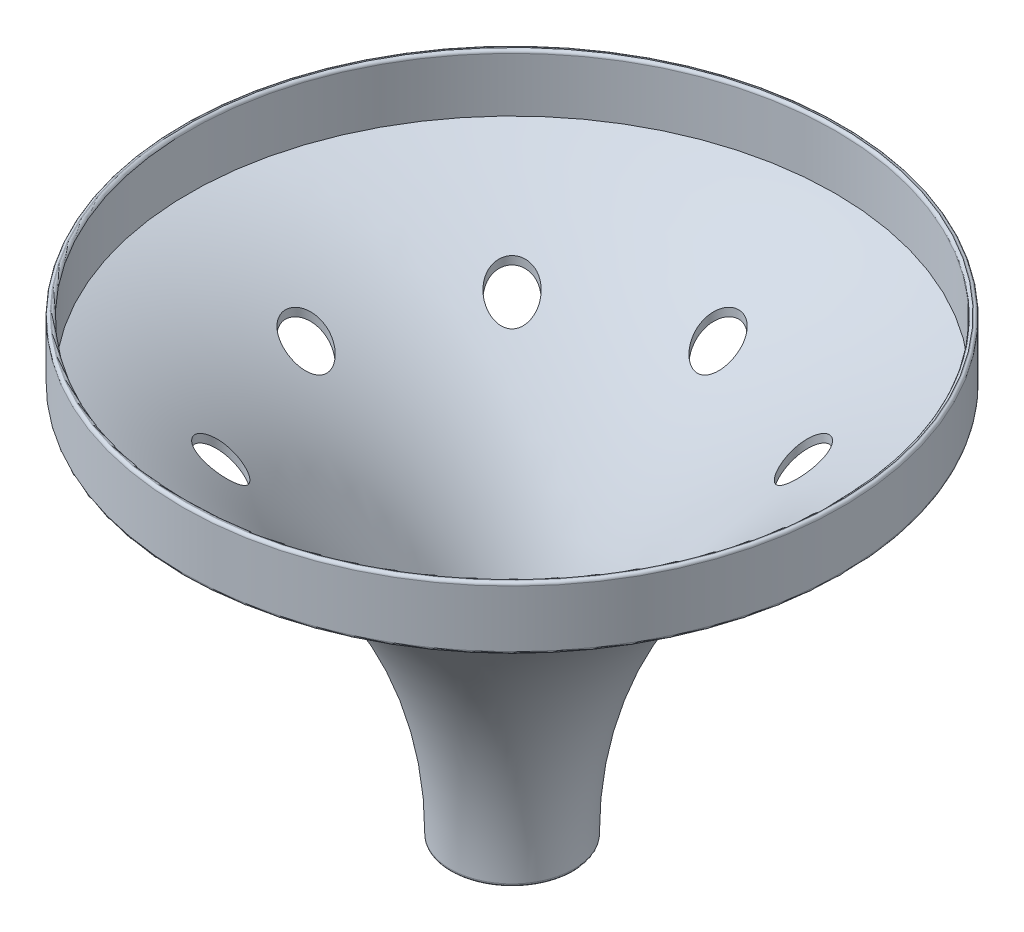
from build123d import *

# Parameters (mm, degrees)
SHELL1_T           = -1.016
SKETCH2_R          = 3.175
CUT_EXTRUDE1_DEPTH = 101.201309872
CIRPATTERN1_COUNT  = 8
FILLET1_R          = 0.4572


with BuildPart() as part:
    # Sketch1 → Revolve1 (revolve)
    with BuildSketch(Plane.XY, mode=Mode.PRIVATE) as revolve1_sk:
        with BuildLine():
            Line((0, 69.85), (50.8, 69.85))
            Line((50.8, 69.85), (50.8, 60.325))
            ThreePointArc((50.8, 60.325), (20.612441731, 36.696750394), (9.525, 0))
            Line((9.525, 0), (0, 0))
            Line((0, 0), (0, 69.85))
        make_face()
    revolve(revolve1_sk.sketch.rotate(Axis((0, 0, 0), (0, 1, 0)), 90), axis=Axis((0, 0, 0), (0, 1, 0)))

    # Shell1
    shell1_openings = [part.faces().sort_by_distance(p)[0] for p in [
        (0, 69.85, 0),
        (0, 0, 0),
    ]]
    offset(amount=SHELL1_T, openings=shell1_openings, kind=Kind.INTERSECTION)

    # Sketch2 → Cut-Extrude1 (cut, through all)
    with BuildSketch(Plane(origin=(0, 0, 0), x_dir=(1, 0, 0), z_dir=(0, 1, 0))):
        with Locations(Location((0, 31.75, 0), (0, 0, 90.000000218))):
            Circle(SKETCH2_R)
    cut_extrude1 = extrude(amount=CUT_EXTRUDE1_DEPTH, mode=Mode.SUBTRACT)

    # CirPattern1: Cut-Extrude1 ×8 about axis
    cirpattern1_axis = Axis((0, 0, 0), (0, 1, 0))
    for i in range(1, CIRPATTERN1_COUNT):
        add(cut_extrude1.rotate(cirpattern1_axis, i * 360 / CIRPATTERN1_COUNT), mode=Mode.SUBTRACT)

    # Fillet1
    fillet1_edges = [part.edges().sort_by_distance(p)[0] for p in [
        (0, 0, 8.508912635),
        (0, 69.85, 49.784),
        (0, 69.85, 50.8),
        (0, 60.325, 50.8),
        (0, 0, 9.525),
    ]]
    fillet(fillet1_edges, radius=FILLET1_R)


solid = part.part
